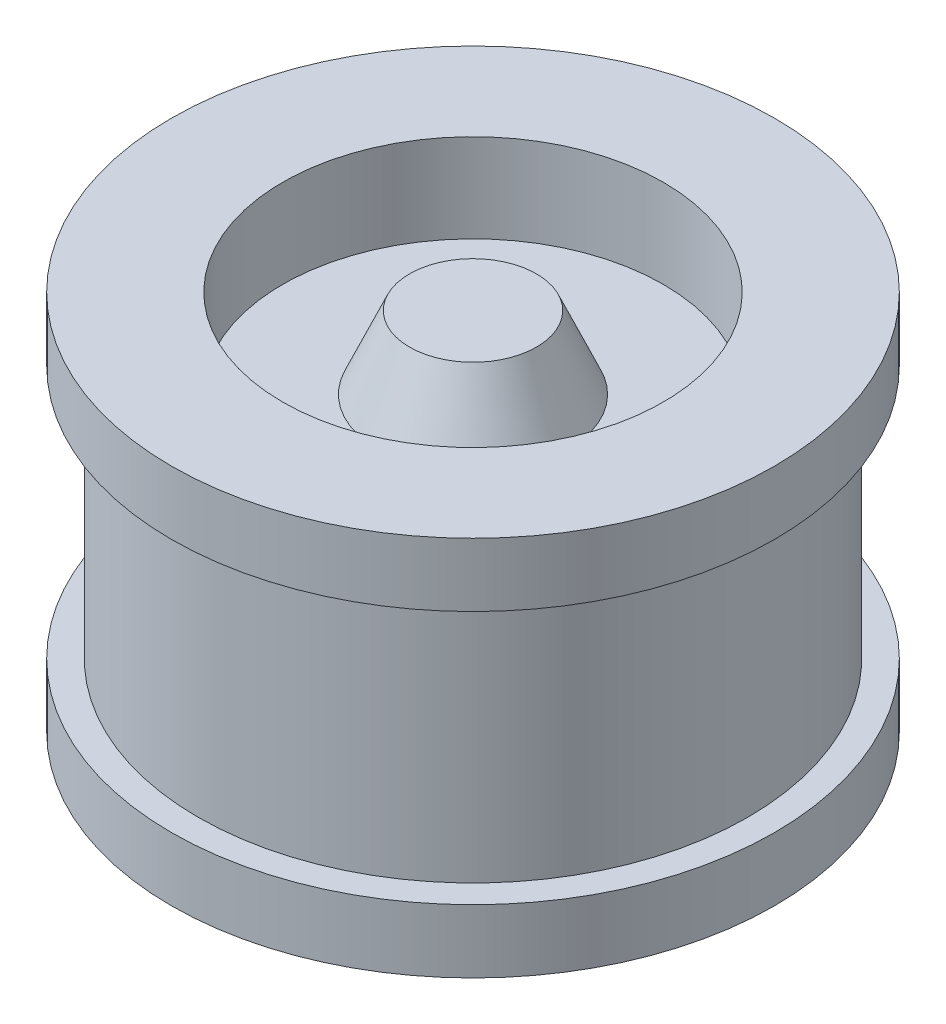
from build123d import *

# Parameters (mm, degrees)
ESQUISSE2_R             = 1
ENL_V_MAT_EXTRU_1_DEPTH = 5.5
CHANFREIN1_SIZE         = 0.25
BOSS_EXTRU_1_DEPTH      = 4


with BuildPart() as part:
    # Esquisse1 → Base-R_volution (revolve)
    with BuildSketch(Plane.XY, mode=Mode.PRIVATE) as base_r_volution_sk:
        Polygon((0, 0), (3, 0), (3, 8), (6.5, 8), (6.5, 2), (9.5, 2), (9.5, 4), (8.662540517, 4), (8.662540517, 12), (9.5, 12), (9.5, 14), (5.999378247, 14), (5.999378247, 11.212054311), (3, 11.212054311), (2, 13.5), (0, 13.5), align=None)
    revolve(base_r_volution_sk.sketch.rotate(Axis((0, 20, 0), (0, -1, 0)), 90), axis=Axis((0, 20, 0), (0, -1, 0)))

    # Esquisse2 → Enl_v. mat.-Extru.1 (cut)
    with BuildSketch(Plane.XZ):
        with Locations(Location((0, 0, 0), (0, 0, 270))):
            Circle(ESQUISSE2_R)
    extrude(amount=-ENL_V_MAT_EXTRU_1_DEPTH, mode=Mode.SUBTRACT)

    # Chanfrein1
    chanfrein1_edges = [part.edges().sort_by_distance(p)[0] for p in [
        (0, 5.5, 1),
    ]]
    chamfer(chanfrein1_edges, length=CHANFREIN1_SIZE)

    # Esquisse5 → Boss.-Extru.1 (add)
    with BuildSketch(Plane.XZ.offset(-8)):
        with BuildLine():
            Line((6.480740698, -0.5), (2.958039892, -0.5))
            ThreePointArc((2.958039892, -0.5), (3, 0), (2.958039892, 0.5))
            Line((2.958039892, 0.5), (6.480740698, 0.5))
            ThreePointArc((6.480740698, 0.5), (6.5, 0), (6.480740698, -0.5))
        make_face()
        with BuildLine():
            Line((0.5, 6.480740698), (0.5, 2.958039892))
            ThreePointArc((0.5, 2.958039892), (0, 3), (-0.5, 2.958039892))
            Line((-0.5, 2.958039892), (-0.5, 6.480740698))
            ThreePointArc((-0.5, 6.480740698), (0, 6.5), (0.5, 6.480740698))
        make_face()
        with BuildLine():
            Line((-0.5, -2.958039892), (-0.5, -6.480740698))
            ThreePointArc((-0.5, -6.480740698), (0, -6.5), (0.5, -6.480740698))
            Line((0.5, -6.480740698), (0.5, -2.958039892))
            ThreePointArc((0.5, -2.958039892), (0, -3), (-0.5, -2.958039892))
        make_face()
        with BuildLine():
            Line((-2.958039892, 0.5), (-6.480740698, 0.5))
            ThreePointArc((-6.480740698, 0.5), (-6.5, 0), (-6.480740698, -0.5))
            Line((-6.480740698, -0.5), (-2.958039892, -0.5))
            ThreePointArc((-2.958039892, -0.5), (-3, 0), (-2.958039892, 0.5))
        make_face()
    extrude(amount=BOSS_EXTRU_1_DEPTH)


solid = part.part
